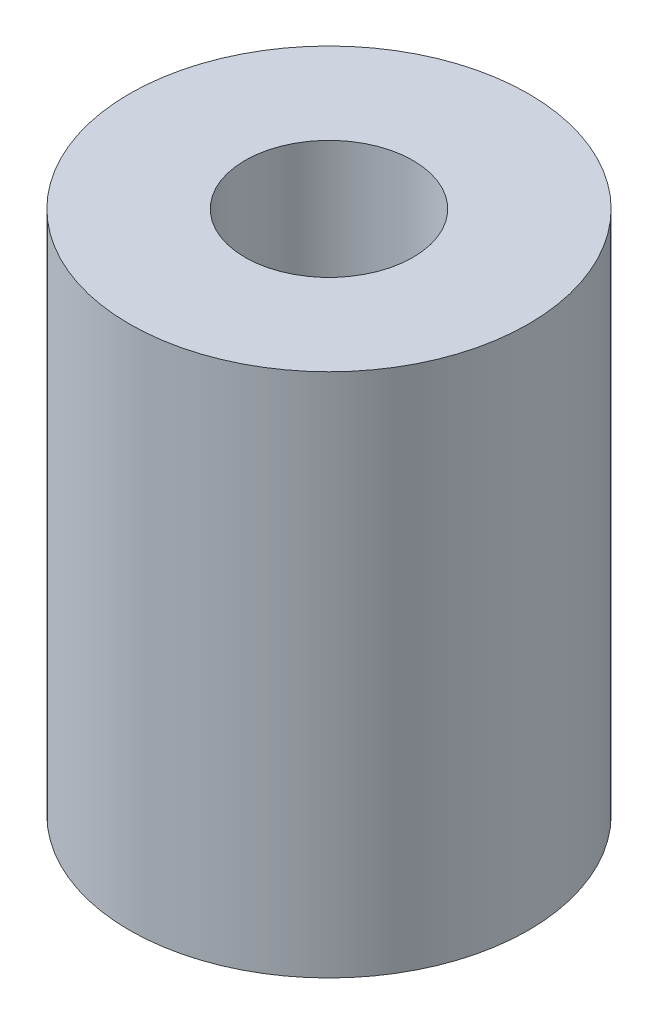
from build123d import *

# Parameters (mm, degrees)
SKETCH1_R           = 9.5
SKETCH1_R_2         = 2.5
BOSS_EXTRUDE1_DEPTH = 25
SKETCH2_R           = 4
CUT_EXTRUDE1_DEPTH  = 12.500000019


with BuildPart() as part:
    # Sketch1 → Boss-Extrude1 (new body)
    with BuildSketch(Plane(origin=(0, 0, 0), x_dir=(1, 0, 0), z_dir=(0, 1, 0))):
        with Locations(Location((0, 0, 0), (0, 0, 270))):
            Circle(SKETCH1_R)
        with Locations(Location((0, 0, 0), (0, 0, 270))):
            Circle(SKETCH1_R_2, mode=Mode.SUBTRACT)
    extrude(amount=BOSS_EXTRUDE1_DEPTH)

    # Sketch2 → Cut-Extrude1 (cut)
    with BuildSketch(Plane(origin=(0, 25, 0), x_dir=(1, 0, 0), z_dir=(0, 1, 0))):
        with Locations(Location((0, 0, 0), (0, 0, 270))):
            Circle(SKETCH2_R)
    extrude(amount=-CUT_EXTRUDE1_DEPTH, mode=Mode.SUBTRACT)


solid = part.part
